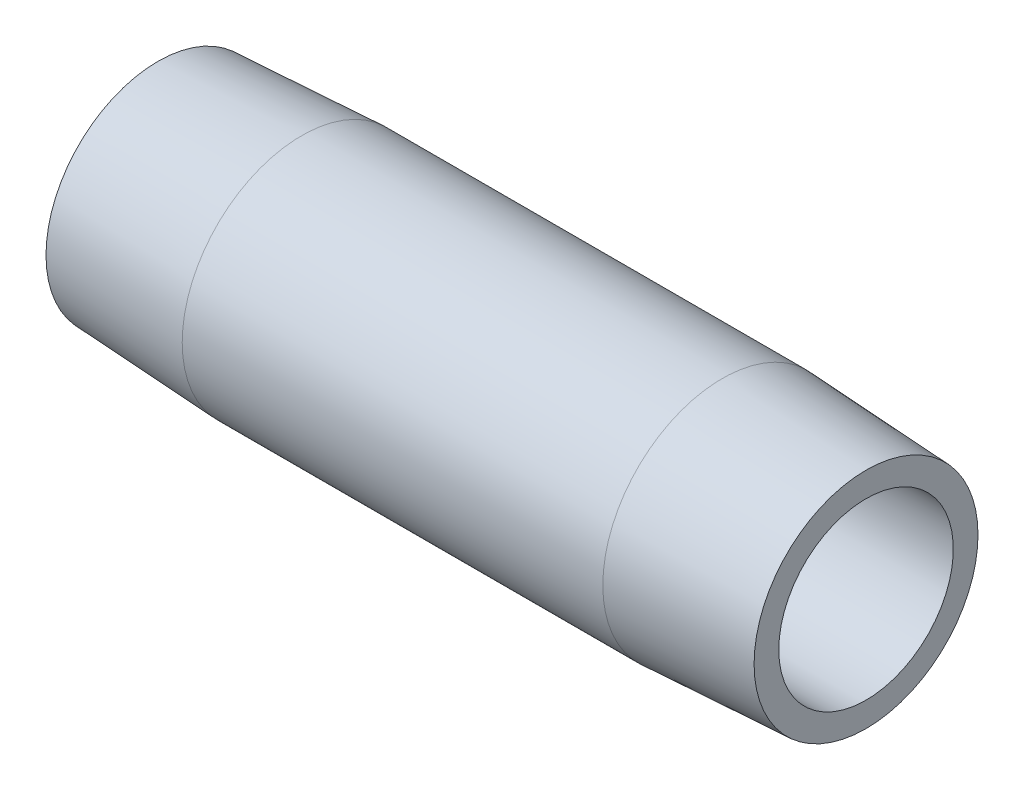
from build123d import *


with BuildPart() as part:
    # Sketch1 → Revolve1 (revolve)
    with BuildSketch(Plane.XY, mode=Mode.PRIVATE) as revolve1_sk:
        Polygon((50.8, 6.2611), (0, 6.2611), (0, 8.032050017), (10.3124, 8.5725), (40.4876, 8.5725), (50.8, 8.032050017), align=None)
    revolve(revolve1_sk.sketch.rotate(Axis((0, 0, 0), (1, 0, 0)), 90), axis=Axis((0, 0, 0), (1, 0, 0)))


solid = part.part
